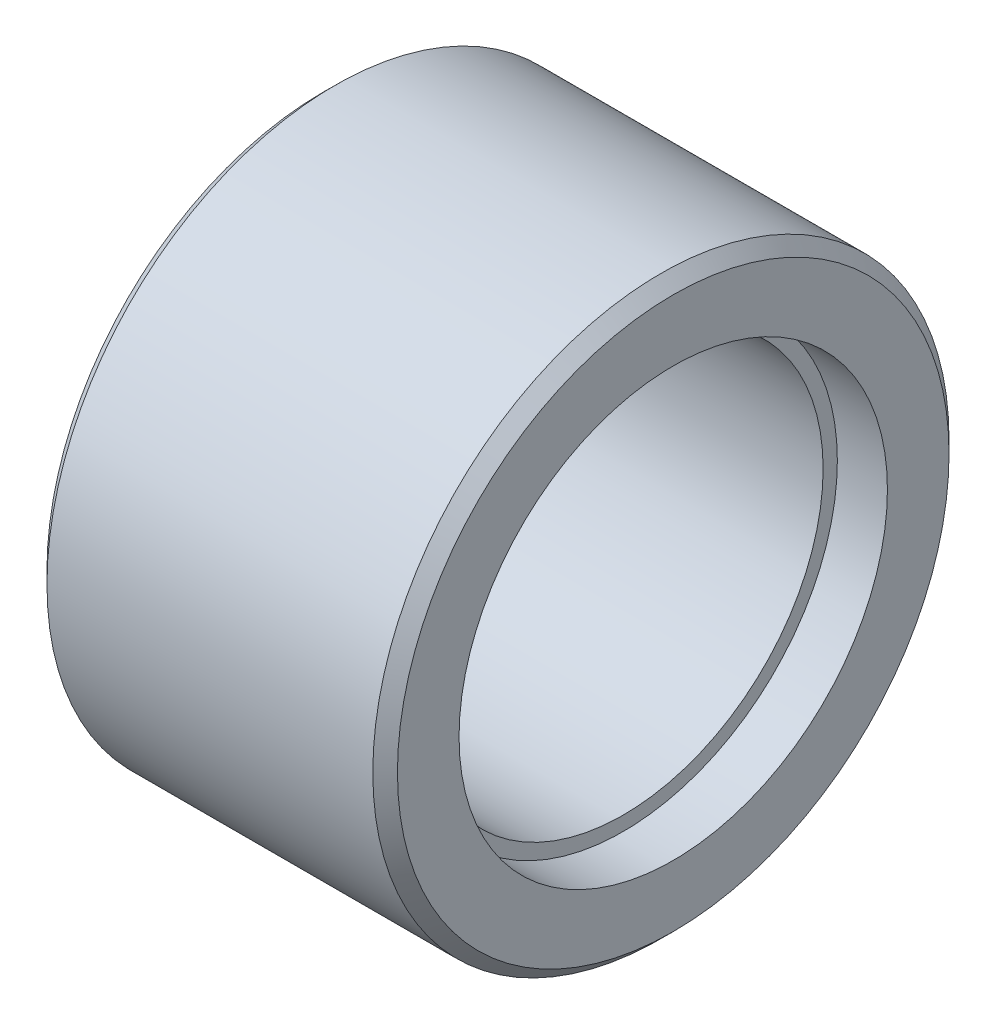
ISO-10303-21;
HEADER;
FILE_DESCRIPTION(('STEP AP214'),'2;1');
FILE_NAME('part.step','',(''),(''),'','','');
FILE_SCHEMA(('AUTOMOTIVE_DESIGN { 1 0 10303 214 1 1 1 1 }'));
ENDSEC;
DATA;
#1=APPLICATION_CONTEXT('core data for automotive mechanical design processes');
#2=APPLICATION_PROTOCOL_DEFINITION('international standard','automotive_design',2000,#1);
#3=PRODUCT_CONTEXT('',#1,'mechanical');
#4=PRODUCT('Part','Part','',(#3));
#5=PRODUCT_RELATED_PRODUCT_CATEGORY('part','',(#4));
#6=PRODUCT_DEFINITION_FORMATION('','',#4);
#7=PRODUCT_DEFINITION_CONTEXT('part definition',#1,'design');
#8=PRODUCT_DEFINITION('design','',#6,#7);
#9=PRODUCT_DEFINITION_SHAPE('','',#8);
#10=(LENGTH_UNIT() NAMED_UNIT(*) SI_UNIT(.MILLI.,.METRE.));
#11=(NAMED_UNIT(*) PLANE_ANGLE_UNIT() SI_UNIT($,.RADIAN.));
#12=(NAMED_UNIT(*) SI_UNIT($,.STERADIAN.) SOLID_ANGLE_UNIT());
#13=UNCERTAINTY_MEASURE_WITH_UNIT(LENGTH_MEASURE(1.E-05),#10,'distance_accuracy_value','');
#14=(GEOMETRIC_REPRESENTATION_CONTEXT(3) GLOBAL_UNCERTAINTY_ASSIGNED_CONTEXT((#13)) GLOBAL_UNIT_ASSIGNED_CONTEXT((#10,
#11,#12)) REPRESENTATION_CONTEXT('',''));
#15=CARTESIAN_POINT('',(0.,0.,0.));
#16=DIRECTION('',(0.,0.,1.));
#17=DIRECTION('',(1.,0.,0.));
#18=AXIS2_PLACEMENT_3D('',#15,#16,#17);
#19=CARTESIAN_POINT('',(-75.8996568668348,11.19315,0.));
#20=DIRECTION('',(-1.,0.,0.));
#21=DIRECTION('',(0.,0.,1.));
#22=AXIS2_PLACEMENT_3D('',#19,#20,#21);
#23=PLANE('',#22);
#24=CARTESIAN_POINT('',(-75.8996568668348,0.,0.));
#25=DIRECTION('',(1.,0.,0.));
#26=DIRECTION('',(0.,0.,-1.));
#27=AXIS2_PLACEMENT_3D('',#24,#25,#26);
#28=CIRCLE('',#27,8.69314999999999);
#29=CARTESIAN_POINT('',(-75.8996568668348,0.,-8.69314999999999));
#30=VERTEX_POINT('',#29);
#31=EDGE_CURVE('E10',#30,#30,#28,.T.);
#32=ORIENTED_EDGE('',*,*,#31,.T.);
#33=EDGE_LOOP('',(#32));
#34=FACE_BOUND('',#33,.T.);
#35=CARTESIAN_POINT('',(-75.8996568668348,0.,0.));
#36=DIRECTION('',(1.,0.,0.));
#37=DIRECTION('',(0.,0.,-1.));
#38=AXIS2_PLACEMENT_3D('',#35,#36,#37);
#39=CIRCLE('',#38,11.19315);
#40=CARTESIAN_POINT('',(-75.8996568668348,0.,-11.19315));
#41=VERTEX_POINT('',#40);
#42=EDGE_CURVE('E71',#41,#41,#39,.T.);
#43=ORIENTED_EDGE('',*,*,#42,.F.);
#44=EDGE_LOOP('',(#43));
#45=FACE_BOUND('',#44,.T.);
#46=ADVANCED_FACE('F37',(#34,#45),#23,.T.);
#47=CARTESIAN_POINT('',(0.,0.,0.));
#48=DIRECTION('',(1.,0.,0.));
#49=DIRECTION('',(0.,0.,-1.));
#50=AXIS2_PLACEMENT_3D('',#47,#48,#49);
#51=CYLINDRICAL_SURFACE('',#50,8.69314999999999);
#52=CARTESIAN_POINT('',(-73.8676568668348,0.,0.));
#53=DIRECTION('',(1.,0.,0.));
#54=DIRECTION('',(0.,0.,-1.));
#55=AXIS2_PLACEMENT_3D('',#52,#53,#54);
#56=CIRCLE('',#55,8.69314999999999);
#57=CARTESIAN_POINT('',(-73.8676568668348,0.,-8.69314999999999));
#58=VERTEX_POINT('',#57);
#59=EDGE_CURVE('E43',#58,#58,#56,.T.);
#60=ORIENTED_EDGE('',*,*,#59,.T.);
#61=EDGE_LOOP('',(#60));
#62=FACE_BOUND('',#61,.T.);
#63=ORIENTED_EDGE('',*,*,#31,.F.);
#64=EDGE_LOOP('',(#63));
#65=FACE_BOUND('',#64,.T.);
#66=ADVANCED_FACE('F79',(#62,#65),#51,.F.);
#67=CARTESIAN_POINT('',(-73.8676568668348,8.69314999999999,0.));
#68=DIRECTION('',(-1.,0.,0.));
#69=DIRECTION('',(0.,0.,1.));
#70=AXIS2_PLACEMENT_3D('',#67,#68,#69);
#71=PLANE('',#70);
#72=CARTESIAN_POINT('',(-73.8676568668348,0.,0.));
#73=DIRECTION('',(1.,0.,0.));
#74=DIRECTION('',(0.,0.,-1.));
#75=AXIS2_PLACEMENT_3D('',#72,#73,#74);
#76=CIRCLE('',#75,8.11529999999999);
#77=CARTESIAN_POINT('',(-73.8676568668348,0.,-8.11529999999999));
#78=VERTEX_POINT('',#77);
#79=EDGE_CURVE('E47',#78,#78,#76,.T.);
#80=ORIENTED_EDGE('',*,*,#79,.T.);
#81=EDGE_LOOP('',(#80));
#82=FACE_BOUND('',#81,.T.);
#83=ORIENTED_EDGE('',*,*,#59,.F.);
#84=EDGE_LOOP('',(#83));
#85=FACE_BOUND('',#84,.T.);
#86=ADVANCED_FACE('F83',(#82,#85),#71,.T.);
#87=CARTESIAN_POINT('',(0.,0.,0.));
#88=DIRECTION('',(1.,0.,0.));
#89=DIRECTION('',(0.,0.,-1.));
#90=AXIS2_PLACEMENT_3D('',#87,#88,#89);
#91=CYLINDRICAL_SURFACE('',#90,8.11529999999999);
#92=CARTESIAN_POINT('',(-63.7076568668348,0.,0.));
#93=DIRECTION('',(1.,0.,0.));
#94=DIRECTION('',(0.,0.,-1.));
#95=AXIS2_PLACEMENT_3D('',#92,#93,#94);
#96=CIRCLE('',#95,8.11529999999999);
#97=CARTESIAN_POINT('',(-63.7076568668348,0.,-8.11529999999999));
#98=VERTEX_POINT('',#97);
#99=EDGE_CURVE('E51',#98,#98,#96,.T.);
#100=ORIENTED_EDGE('',*,*,#99,.T.);
#101=EDGE_LOOP('',(#100));
#102=FACE_BOUND('',#101,.T.);
#103=ORIENTED_EDGE('',*,*,#79,.F.);
#104=EDGE_LOOP('',(#103));
#105=FACE_BOUND('',#104,.T.);
#106=ADVANCED_FACE('F87',(#102,#105),#91,.F.);
#107=CARTESIAN_POINT('',(-63.7076568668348,8.11529999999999,0.));
#108=DIRECTION('',(1.,0.,0.));
#109=DIRECTION('',(0.,0.,-1.));
#110=AXIS2_PLACEMENT_3D('',#107,#108,#109);
#111=PLANE('',#110);
#112=CARTESIAN_POINT('',(-63.7076568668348,0.,0.));
#113=DIRECTION('',(1.,0.,0.));
#114=DIRECTION('',(0.,0.,-1.));
#115=AXIS2_PLACEMENT_3D('',#112,#113,#114);
#116=CIRCLE('',#115,8.69315);
#117=CARTESIAN_POINT('',(-63.7076568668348,0.,-8.69315));
#118=VERTEX_POINT('',#117);
#119=EDGE_CURVE('E56',#118,#118,#116,.T.);
#120=ORIENTED_EDGE('',*,*,#119,.T.);
#121=EDGE_LOOP('',(#120));
#122=FACE_BOUND('',#121,.T.);
#123=ORIENTED_EDGE('',*,*,#99,.F.);
#124=EDGE_LOOP('',(#123));
#125=FACE_BOUND('',#124,.T.);
#126=ADVANCED_FACE('F94',(#122,#125),#111,.T.);
#127=CARTESIAN_POINT('',(0.,0.,0.));
#128=DIRECTION('',(1.,0.,0.));
#129=DIRECTION('',(0.,0.,-1.));
#130=AXIS2_PLACEMENT_3D('',#127,#128,#129);
#131=CYLINDRICAL_SURFACE('',#130,8.69314999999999);
#132=CARTESIAN_POINT('',(-61.6756568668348,0.,0.));
#133=DIRECTION('',(1.,0.,0.));
#134=DIRECTION('',(0.,0.,-1.));
#135=AXIS2_PLACEMENT_3D('',#132,#133,#134);
#136=CIRCLE('',#135,8.69314999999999);
#137=CARTESIAN_POINT('',(-61.6756568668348,0.,-8.69314999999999));
#138=VERTEX_POINT('',#137);
#139=EDGE_CURVE('E59',#138,#138,#136,.T.);
#140=ORIENTED_EDGE('',*,*,#139,.T.);
#141=EDGE_LOOP('',(#140));
#142=FACE_BOUND('',#141,.T.);
#143=ORIENTED_EDGE('',*,*,#119,.F.);
#144=EDGE_LOOP('',(#143));
#145=FACE_BOUND('',#144,.T.);
#146=ADVANCED_FACE('F98',(#142,#145),#131,.F.);
#147=CARTESIAN_POINT('',(-61.6756568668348,8.69314999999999,0.));
#148=DIRECTION('',(1.,0.,0.));
#149=DIRECTION('',(0.,0.,-1.));
#150=AXIS2_PLACEMENT_3D('',#147,#148,#149);
#151=PLANE('',#150);
#152=CARTESIAN_POINT('',(-61.6756568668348,0.,0.));
#153=DIRECTION('',(1.,0.,0.));
#154=DIRECTION('',(0.,0.,-1.));
#155=AXIS2_PLACEMENT_3D('',#152,#153,#154);
#156=CIRCLE('',#155,11.19315);
#157=CARTESIAN_POINT('',(-61.6756568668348,0.,-11.19315));
#158=VERTEX_POINT('',#157);
#159=EDGE_CURVE('E62',#158,#158,#156,.T.);
#160=ORIENTED_EDGE('',*,*,#159,.T.);
#161=EDGE_LOOP('',(#160));
#162=FACE_BOUND('',#161,.T.);
#163=ORIENTED_EDGE('',*,*,#139,.F.);
#164=EDGE_LOOP('',(#163));
#165=FACE_BOUND('',#164,.T.);
#166=ADVANCED_FACE('F102',(#162,#165),#151,.T.);
#167=CARTESIAN_POINT('',(-61.6756568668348,0.,0.));
#168=DIRECTION('',(-1.,0.,0.));
#169=DIRECTION('',(0.,0.,1.));
#170=AXIS2_PLACEMENT_3D('',#167,#168,#169);
#171=CONICAL_SURFACE('',#170,11.19315,0.785398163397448);
#172=CARTESIAN_POINT('',(-62.1756568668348,0.,0.));
#173=DIRECTION('',(1.,0.,0.));
#174=DIRECTION('',(0.,0.,-1.));
#175=AXIS2_PLACEMENT_3D('',#172,#173,#174);
#176=CIRCLE('',#175,11.69315);
#177=CARTESIAN_POINT('',(-62.1756568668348,0.,-11.69315));
#178=VERTEX_POINT('',#177);
#179=EDGE_CURVE('E65',#178,#178,#176,.T.);
#180=ORIENTED_EDGE('',*,*,#179,.T.);
#181=EDGE_LOOP('',(#180));
#182=FACE_BOUND('',#181,.T.);
#183=ORIENTED_EDGE('',*,*,#159,.F.);
#184=EDGE_LOOP('',(#183));
#185=FACE_BOUND('',#184,.T.);
#186=ADVANCED_FACE('F106',(#182,#185),#171,.T.);
#187=CARTESIAN_POINT('',(0.,0.,0.));
#188=DIRECTION('',(1.,0.,0.));
#189=DIRECTION('',(0.,0.,-1.));
#190=AXIS2_PLACEMENT_3D('',#187,#188,#189);
#191=CYLINDRICAL_SURFACE('',#190,11.69315);
#192=CARTESIAN_POINT('',(-75.3996568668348,0.,0.));
#193=DIRECTION('',(1.,0.,0.));
#194=DIRECTION('',(0.,0.,-1.));
#195=AXIS2_PLACEMENT_3D('',#192,#193,#194);
#196=CIRCLE('',#195,11.69315);
#197=CARTESIAN_POINT('',(-75.3996568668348,0.,-11.69315));
#198=VERTEX_POINT('',#197);
#199=EDGE_CURVE('E68',#198,#198,#196,.T.);
#200=ORIENTED_EDGE('',*,*,#199,.T.);
#201=EDGE_LOOP('',(#200));
#202=FACE_BOUND('',#201,.T.);
#203=ORIENTED_EDGE('',*,*,#179,.F.);
#204=EDGE_LOOP('',(#203));
#205=FACE_BOUND('',#204,.T.);
#206=ADVANCED_FACE('F110',(#202,#205),#191,.T.);
#207=CARTESIAN_POINT('',(-75.3996568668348,0.,0.));
#208=DIRECTION('',(1.,0.,0.));
#209=DIRECTION('',(0.,0.,-1.));
#210=AXIS2_PLACEMENT_3D('',#207,#208,#209);
#211=CONICAL_SURFACE('',#210,11.69315,0.785398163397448);
#212=ORIENTED_EDGE('',*,*,#42,.T.);
#213=EDGE_LOOP('',(#212));
#214=FACE_BOUND('',#213,.T.);
#215=ORIENTED_EDGE('',*,*,#199,.F.);
#216=EDGE_LOOP('',(#215));
#217=FACE_BOUND('',#216,.T.);
#218=ADVANCED_FACE('F75',(#214,#217),#211,.T.);
#219=CLOSED_SHELL('',(#46,#66,#86,#106,#126,#146,#166,#186,#206,#218));
#220=MANIFOLD_SOLID_BREP('B2',#219);
#221=ADVANCED_BREP_SHAPE_REPRESENTATION('',(#18,#220),#14);
#222=SHAPE_DEFINITION_REPRESENTATION(#9,#221);
ENDSEC;
END-ISO-10303-21;
